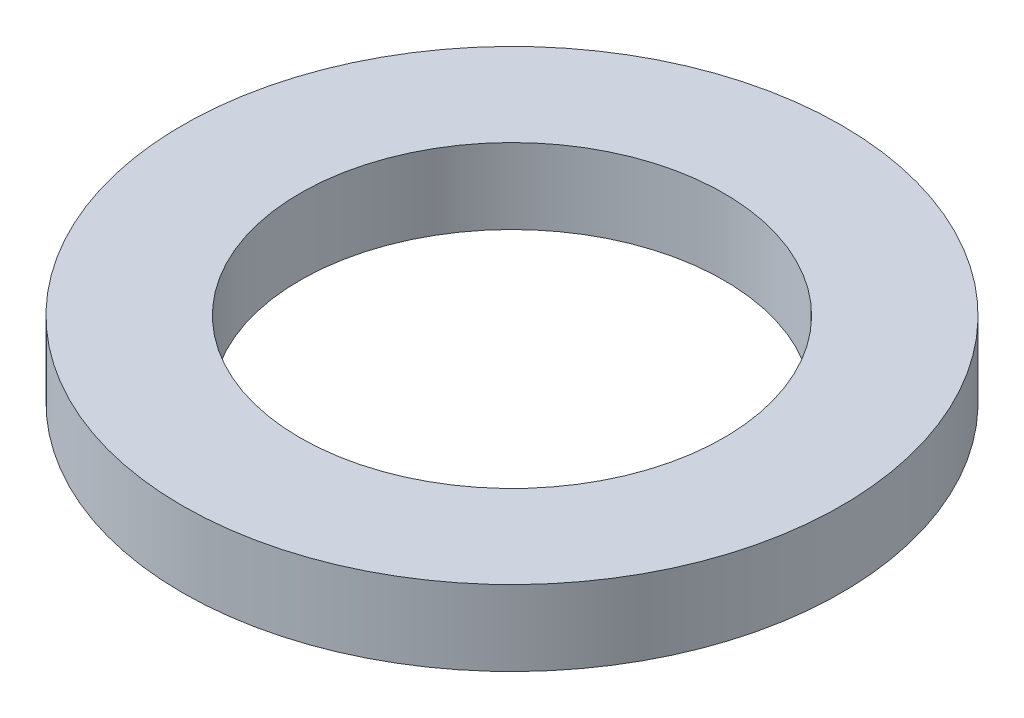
from build123d import *

# Parameters (mm, degrees)
BODYSKE_W = 2.5
BODYSKE_H = 1.6


with BuildPart() as part:
    # BodySke → BaseBody (revolve)
    with BuildSketch(Plane(origin=(0, 0, 0), x_dir=(1, 0, 0), z_dir=(0, 0, -1)), mode=Mode.PRIVATE) as basebody_sk:
        with Locations((5.75, 0.8)):
            Rectangle(BODYSKE_W, BODYSKE_H)
    revolve(basebody_sk.sketch.rotate(Axis((0, 0, 0), (0, -1, 0)), 90), axis=Axis((0, 0, 0), (0, -1, 0)))


solid = part.part
